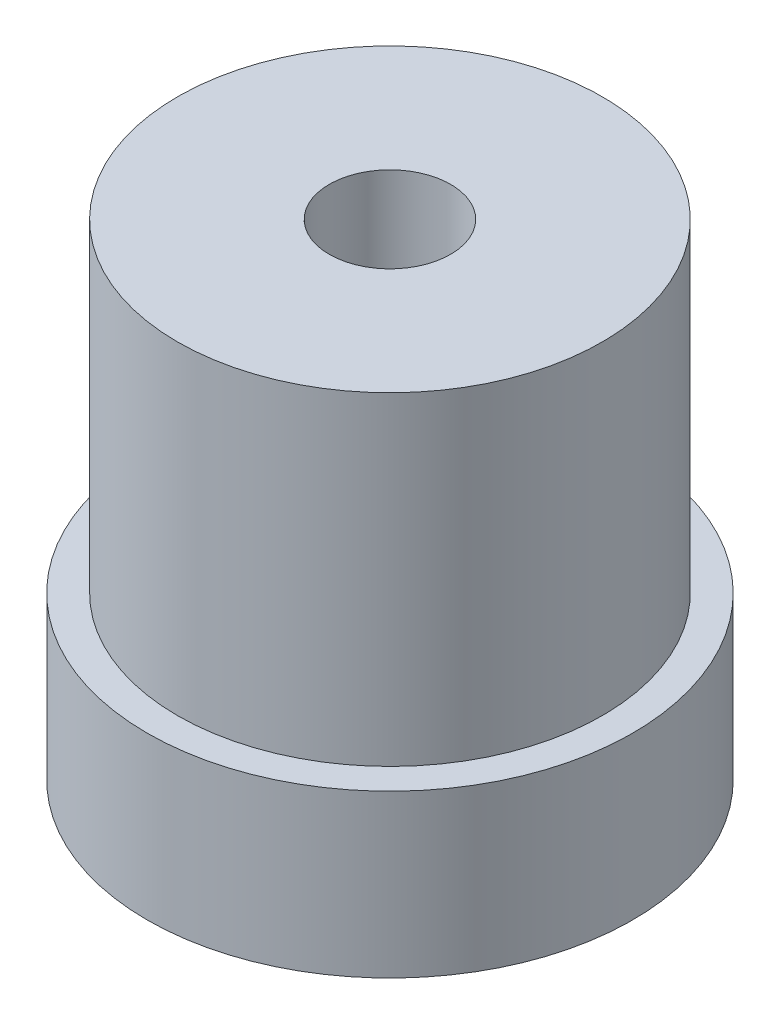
ISO-10303-21;
HEADER;
FILE_DESCRIPTION(('STEP AP214'),'2;1');
FILE_NAME('part.step','',(''),(''),'','','');
FILE_SCHEMA(('AUTOMOTIVE_DESIGN { 1 0 10303 214 1 1 1 1 }'));
ENDSEC;
DATA;
#1=APPLICATION_CONTEXT('core data for automotive mechanical design processes');
#2=APPLICATION_PROTOCOL_DEFINITION('international standard','automotive_design',2000,#1);
#3=PRODUCT_CONTEXT('',#1,'mechanical');
#4=PRODUCT('Part','Part','',(#3));
#5=PRODUCT_RELATED_PRODUCT_CATEGORY('part','',(#4));
#6=PRODUCT_DEFINITION_FORMATION('','',#4);
#7=PRODUCT_DEFINITION_CONTEXT('part definition',#1,'design');
#8=PRODUCT_DEFINITION('design','',#6,#7);
#9=PRODUCT_DEFINITION_SHAPE('','',#8);
#10=(LENGTH_UNIT() NAMED_UNIT(*) SI_UNIT(.MILLI.,.METRE.));
#11=(NAMED_UNIT(*) PLANE_ANGLE_UNIT() SI_UNIT($,.RADIAN.));
#12=(NAMED_UNIT(*) SI_UNIT($,.STERADIAN.) SOLID_ANGLE_UNIT());
#13=UNCERTAINTY_MEASURE_WITH_UNIT(LENGTH_MEASURE(1.E-05),#10,'distance_accuracy_value','');
#14=(GEOMETRIC_REPRESENTATION_CONTEXT(3) GLOBAL_UNCERTAINTY_ASSIGNED_CONTEXT((#13)) GLOBAL_UNIT_ASSIGNED_CONTEXT((#10,
#11,#12)) REPRESENTATION_CONTEXT('',''));
#15=CARTESIAN_POINT('',(0.,0.,0.));
#16=DIRECTION('',(0.,0.,1.));
#17=DIRECTION('',(1.,0.,0.));
#18=AXIS2_PLACEMENT_3D('',#15,#16,#17);
#19=CARTESIAN_POINT('',(0.,50.8,0.));
#20=DIRECTION('',(0.,-1.,0.));
#21=DIRECTION('',(0.,0.,-1.));
#22=AXIS2_PLACEMENT_3D('',#19,#20,#21);
#23=CYLINDRICAL_SURFACE('',#22,76.2);
#24=CARTESIAN_POINT('',(0.,50.8,0.));
#25=DIRECTION('',(0.,1.,0.));
#26=DIRECTION('',(0.,0.,1.));
#27=AXIS2_PLACEMENT_3D('',#24,#25,#26);
#28=CIRCLE('',#27,76.2);
#29=CARTESIAN_POINT('',(0.,50.8,76.2));
#30=VERTEX_POINT('',#29);
#31=EDGE_CURVE('E46',#30,#30,#28,.T.);
#32=ORIENTED_EDGE('',*,*,#31,.F.);
#33=EDGE_LOOP('',(#32));
#34=FACE_BOUND('',#33,.T.);
#35=CARTESIAN_POINT('',(0.,0.,0.));
#36=DIRECTION('',(0.,1.,0.));
#37=DIRECTION('',(0.,0.,1.));
#38=AXIS2_PLACEMENT_3D('',#35,#36,#37);
#39=CIRCLE('',#38,76.2);
#40=CARTESIAN_POINT('',(0.,0.,76.2));
#41=VERTEX_POINT('',#40);
#42=EDGE_CURVE('E42',#41,#41,#39,.T.);
#43=ORIENTED_EDGE('',*,*,#42,.T.);
#44=EDGE_LOOP('',(#43));
#45=FACE_BOUND('',#44,.T.);
#46=ADVANCED_FACE('F39',(#34,#45),#23,.T.);
#47=CARTESIAN_POINT('',(0.,50.8,0.));
#48=DIRECTION('',(0.,1.,0.));
#49=DIRECTION('',(0.,0.,1.));
#50=AXIS2_PLACEMENT_3D('',#47,#48,#49);
#51=PLANE('',#50);
#52=CARTESIAN_POINT('',(0.,50.8,0.));
#53=DIRECTION('',(0.,1.,0.));
#54=DIRECTION('',(0.,0.,1.));
#55=AXIS2_PLACEMENT_3D('',#52,#53,#54);
#56=CIRCLE('',#55,66.675);
#57=CARTESIAN_POINT('',(0.,50.8,66.675));
#58=VERTEX_POINT('',#57);
#59=EDGE_CURVE('E10',#58,#58,#56,.T.);
#60=ORIENTED_EDGE('',*,*,#59,.F.);
#61=EDGE_LOOP('',(#60));
#62=FACE_BOUND('',#61,.T.);
#63=ORIENTED_EDGE('',*,*,#31,.T.);
#64=EDGE_LOOP('',(#63));
#65=FACE_BOUND('',#64,.T.);
#66=ADVANCED_FACE('F84',(#62,#65),#51,.T.);
#67=CARTESIAN_POINT('',(0.,0.,0.));
#68=DIRECTION('',(0.,1.,0.));
#69=DIRECTION('',(0.,0.,1.));
#70=AXIS2_PLACEMENT_3D('',#67,#68,#69);
#71=PLANE('',#70);
#72=ORIENTED_EDGE('',*,*,#42,.F.);
#73=EDGE_LOOP('',(#72));
#74=FACE_BOUND('',#73,.T.);
#75=ADVANCED_FACE('F78',(#74),#71,.F.);
#76=CARTESIAN_POINT('',(0.,152.4,0.));
#77=DIRECTION('',(0.,-1.,0.));
#78=DIRECTION('',(0.,0.,-1.));
#79=AXIS2_PLACEMENT_3D('',#76,#77,#78);
#80=CYLINDRICAL_SURFACE('',#79,66.675);
#81=CARTESIAN_POINT('',(0.,152.4,0.));
#82=DIRECTION('',(0.,1.,0.));
#83=DIRECTION('',(0.,0.,1.));
#84=AXIS2_PLACEMENT_3D('',#81,#82,#83);
#85=CIRCLE('',#84,66.675);
#86=CARTESIAN_POINT('',(0.,152.4,66.675));
#87=VERTEX_POINT('',#86);
#88=EDGE_CURVE('E52',#87,#87,#85,.T.);
#89=ORIENTED_EDGE('',*,*,#88,.F.);
#90=EDGE_LOOP('',(#89));
#91=FACE_BOUND('',#90,.T.);
#92=ORIENTED_EDGE('',*,*,#59,.T.);
#93=EDGE_LOOP('',(#92));
#94=FACE_BOUND('',#93,.T.);
#95=ADVANCED_FACE('F73',(#91,#94),#80,.T.);
#96=CARTESIAN_POINT('',(0.,152.4,0.));
#97=DIRECTION('',(0.,1.,0.));
#98=DIRECTION('',(0.,0.,1.));
#99=AXIS2_PLACEMENT_3D('',#96,#97,#98);
#100=PLANE('',#99);
#101=CARTESIAN_POINT('',(0.,152.4,0.));
#102=DIRECTION('',(0.,1.,0.));
#103=DIRECTION('',(0.,0.,1.));
#104=AXIS2_PLACEMENT_3D('',#101,#102,#103);
#105=CIRCLE('',#104,19.05);
#106=CARTESIAN_POINT('',(0.,152.4,19.05));
#107=VERTEX_POINT('',#106);
#108=EDGE_CURVE('E56',#107,#107,#105,.T.);
#109=ORIENTED_EDGE('',*,*,#108,.F.);
#110=EDGE_LOOP('',(#109));
#111=FACE_BOUND('',#110,.T.);
#112=ORIENTED_EDGE('',*,*,#88,.T.);
#113=EDGE_LOOP('',(#112));
#114=FACE_BOUND('',#113,.T.);
#115=ADVANCED_FACE('F67',(#111,#114),#100,.T.);
#116=CARTESIAN_POINT('',(0.,114.3,0.));
#117=DIRECTION('',(0.,1.,0.));
#118=DIRECTION('',(0.,0.,1.));
#119=AXIS2_PLACEMENT_3D('',#116,#117,#118);
#120=CYLINDRICAL_SURFACE('',#119,19.05);
#121=CARTESIAN_POINT('',(0.,114.3,0.));
#122=DIRECTION('',(0.,1.,0.));
#123=DIRECTION('',(0.,0.,1.));
#124=AXIS2_PLACEMENT_3D('',#121,#122,#123);
#125=CIRCLE('',#124,19.05);
#126=CARTESIAN_POINT('',(0.,114.3,19.05));
#127=VERTEX_POINT('',#126);
#128=EDGE_CURVE('E55',#127,#127,#125,.T.);
#129=CARTESIAN_POINT('',(0.,114.3,19.05));
#130=CARTESIAN_POINT('',(0.,114.696875,19.05));
#131=CARTESIAN_POINT('',(0.,115.09375,19.05));
#132=CARTESIAN_POINT('',(0.,115.8875,19.05));
#133=CARTESIAN_POINT('',(0.,116.284375,19.05));
#134=CARTESIAN_POINT('',(0.,117.078125,19.05));
#135=CARTESIAN_POINT('',(0.,117.475,19.05));
#136=CARTESIAN_POINT('',(0.,118.26875,19.05));
#137=CARTESIAN_POINT('',(0.,118.665625,19.05));
#138=CARTESIAN_POINT('',(0.,119.459375,19.05));
#139=CARTESIAN_POINT('',(0.,119.85625,19.05));
#140=CARTESIAN_POINT('',(0.,120.65,19.05));
#141=CARTESIAN_POINT('',(0.,121.046875,19.05));
#142=CARTESIAN_POINT('',(0.,121.840625,19.05));
#143=CARTESIAN_POINT('',(0.,122.2375,19.05));
#144=CARTESIAN_POINT('',(0.,123.03125,19.05));
#145=CARTESIAN_POINT('',(0.,123.428125,19.05));
#146=CARTESIAN_POINT('',(0.,124.221875,19.05));
#147=CARTESIAN_POINT('',(0.,124.61875,19.05));
#148=CARTESIAN_POINT('',(0.,125.4125,19.05));
#149=CARTESIAN_POINT('',(0.,125.809375,19.05));
#150=CARTESIAN_POINT('',(0.,126.603125,19.05));
#151=CARTESIAN_POINT('',(0.,127.,19.05));
#152=CARTESIAN_POINT('',(0.,127.79375,19.05));
#153=CARTESIAN_POINT('',(0.,128.190625,19.05));
#154=CARTESIAN_POINT('',(0.,128.984375,19.05));
#155=CARTESIAN_POINT('',(0.,129.38125,19.05));
#156=CARTESIAN_POINT('',(0.,130.175,19.05));
#157=CARTESIAN_POINT('',(0.,130.571875,19.05));
#158=CARTESIAN_POINT('',(0.,131.365625,19.05));
#159=CARTESIAN_POINT('',(0.,131.7625,19.05));
#160=CARTESIAN_POINT('',(0.,132.55625,19.05));
#161=CARTESIAN_POINT('',(0.,132.953125,19.05));
#162=CARTESIAN_POINT('',(0.,133.746875,19.05));
#163=CARTESIAN_POINT('',(0.,134.14375,19.05));
#164=CARTESIAN_POINT('',(0.,134.9375,19.05));
#165=CARTESIAN_POINT('',(0.,135.334375,19.05));
#166=CARTESIAN_POINT('',(0.,136.128125,19.05));
#167=CARTESIAN_POINT('',(0.,136.525,19.05));
#168=CARTESIAN_POINT('',(0.,137.31875,19.05));
#169=CARTESIAN_POINT('',(0.,137.715625,19.05));
#170=CARTESIAN_POINT('',(0.,138.509375,19.05));
#171=CARTESIAN_POINT('',(0.,138.90625,19.05));
#172=CARTESIAN_POINT('',(0.,139.7,19.05));
#173=CARTESIAN_POINT('',(0.,140.096875,19.05));
#174=CARTESIAN_POINT('',(0.,140.890625,19.05));
#175=CARTESIAN_POINT('',(0.,141.2875,19.05));
#176=CARTESIAN_POINT('',(0.,142.08125,19.05));
#177=CARTESIAN_POINT('',(0.,142.478125,19.05));
#178=CARTESIAN_POINT('',(0.,143.271875,19.05));
#179=CARTESIAN_POINT('',(0.,143.66875,19.05));
#180=CARTESIAN_POINT('',(0.,144.4625,19.05));
#181=CARTESIAN_POINT('',(0.,144.859375,19.05));
#182=CARTESIAN_POINT('',(0.,145.653125,19.05));
#183=CARTESIAN_POINT('',(0.,146.05,19.05));
#184=CARTESIAN_POINT('',(0.,146.84375,19.05));
#185=CARTESIAN_POINT('',(0.,147.240625,19.05));
#186=CARTESIAN_POINT('',(0.,148.034375,19.05));
#187=CARTESIAN_POINT('',(0.,148.43125,19.05));
#188=CARTESIAN_POINT('',(0.,149.225,19.05));
#189=CARTESIAN_POINT('',(0.,149.621875,19.05));
#190=CARTESIAN_POINT('',(0.,150.415625,19.05));
#191=CARTESIAN_POINT('',(0.,150.8125,19.05));
#192=CARTESIAN_POINT('',(0.,151.60625,19.05));
#193=CARTESIAN_POINT('',(0.,152.003125,19.05));
#194=CARTESIAN_POINT('',(0.,152.4,19.05));
#195=B_SPLINE_CURVE_WITH_KNOTS('',3,(#129,#130,#131,#132,#133,#134,#135,#136,#137,#138,#139,
#140,#141,#142,#143,#144,#145,#146,#147,#148,#149,#150,#151,#152,#153,#154,#155,#156,#157,#158,
#159,#160,#161,#162,#163,#164,#165,#166,#167,#168,#169,#170,#171,#172,#173,#174,#175,#176,#177,
#178,#179,#180,#181,#182,#183,#184,#185,#186,#187,#188,#189,#190,#191,#192,#193,#194),
.UNSPECIFIED.,.F.,.F.,(4,2,2,2,2,2,2,2,2,2,2,2,2,2,2,2,2,2,2,2,2,2,2,2,2,2,2,2,2,2,2,2,4),(0.,
1.190625,2.38125,3.571875,4.7625,5.953125,7.14375,8.334375,9.52500000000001,10.715625,11.90625,
13.096875,14.2875,15.478125,16.66875,17.859375,19.05,20.240625,21.43125,22.621875,23.8125,
25.003125,26.19375,27.384375,28.575,29.765625,30.95625,32.146875,33.3375,34.528125,35.71875,
36.909375,38.1),.UNSPECIFIED.);
#196=EDGE_CURVE('BSEAM64',#127,#107,#195,.T.);
#197=ORIENTED_EDGE('',*,*,#128,.F.);
#198=ORIENTED_EDGE('',*,*,#108,.T.);
#199=ORIENTED_EDGE('',*,*,#196,.T.);
#200=ORIENTED_EDGE('',*,*,#196,.F.);
#201=EDGE_LOOP('',(#197,#199,#198,#200));
#202=FACE_BOUND('',#201,.T.);
#203=ADVANCED_FACE('F64',(#202),#120,.F.);
#204=CARTESIAN_POINT('',(0.,114.3,0.));
#205=DIRECTION('',(0.,1.,0.));
#206=DIRECTION('',(0.,0.,1.));
#207=AXIS2_PLACEMENT_3D('',#204,#205,#206);
#208=PLANE('',#207);
#209=ORIENTED_EDGE('',*,*,#128,.T.);
#210=EDGE_LOOP('',(#209));
#211=FACE_BOUND('',#210,.T.);
#212=ADVANCED_FACE('F62',(#211),#208,.T.);
#213=CLOSED_SHELL('',(#46,#66,#75,#95,#115,#203,#212));
#214=MANIFOLD_SOLID_BREP('B2',#213);
#215=ADVANCED_BREP_SHAPE_REPRESENTATION('',(#18,#214),#14);
#216=SHAPE_DEFINITION_REPRESENTATION(#9,#215);
ENDSEC;
END-ISO-10303-21;
